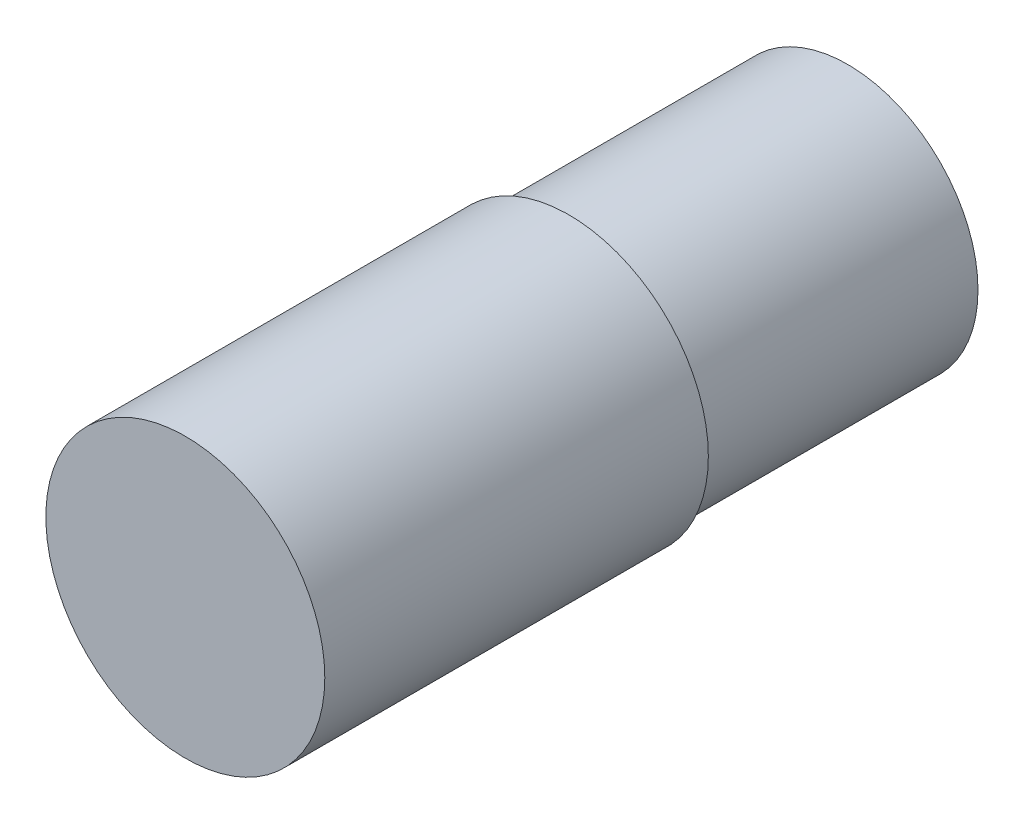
ISO-10303-21;
HEADER;
FILE_DESCRIPTION(('STEP AP214'),'2;1');
FILE_NAME('part.step','',(''),(''),'','','');
FILE_SCHEMA(('AUTOMOTIVE_DESIGN { 1 0 10303 214 1 1 1 1 }'));
ENDSEC;
DATA;
#1=APPLICATION_CONTEXT('core data for automotive mechanical design processes');
#2=APPLICATION_PROTOCOL_DEFINITION('international standard','automotive_design',2000,#1);
#3=PRODUCT_CONTEXT('',#1,'mechanical');
#4=PRODUCT('Part','Part','',(#3));
#5=PRODUCT_RELATED_PRODUCT_CATEGORY('part','',(#4));
#6=PRODUCT_DEFINITION_FORMATION('','',#4);
#7=PRODUCT_DEFINITION_CONTEXT('part definition',#1,'design');
#8=PRODUCT_DEFINITION('design','',#6,#7);
#9=PRODUCT_DEFINITION_SHAPE('','',#8);
#10=(LENGTH_UNIT() NAMED_UNIT(*) SI_UNIT(.MILLI.,.METRE.));
#11=(NAMED_UNIT(*) PLANE_ANGLE_UNIT() SI_UNIT($,.RADIAN.));
#12=(NAMED_UNIT(*) SI_UNIT($,.STERADIAN.) SOLID_ANGLE_UNIT());
#13=UNCERTAINTY_MEASURE_WITH_UNIT(LENGTH_MEASURE(1.E-05),#10,'distance_accuracy_value','');
#14=(GEOMETRIC_REPRESENTATION_CONTEXT(3) GLOBAL_UNCERTAINTY_ASSIGNED_CONTEXT((#13)) GLOBAL_UNIT_ASSIGNED_CONTEXT((#10,
#11,#12)) REPRESENTATION_CONTEXT('',''));
#15=CARTESIAN_POINT('',(0.,0.,0.));
#16=DIRECTION('',(0.,0.,1.));
#17=DIRECTION('',(1.,0.,0.));
#18=AXIS2_PLACEMENT_3D('',#15,#16,#17);
#19=CARTESIAN_POINT('',(0.,0.,60.));
#20=DIRECTION('',(0.,0.,-1.));
#21=DIRECTION('',(-1.,0.,0.));
#22=AXIS2_PLACEMENT_3D('',#19,#20,#21);
#23=CYLINDRICAL_SURFACE('',#22,28.);
#24=CARTESIAN_POINT('',(0.,0.,60.));
#25=DIRECTION('',(0.,0.,1.));
#26=DIRECTION('',(1.,0.,0.));
#27=AXIS2_PLACEMENT_3D('',#24,#25,#26);
#28=CIRCLE('',#27,28.);
#29=CARTESIAN_POINT('',(28.,0.,60.));
#30=VERTEX_POINT('',#29);
#31=EDGE_CURVE('E10',#30,#30,#28,.T.);
#32=ORIENTED_EDGE('',*,*,#31,.F.);
#33=EDGE_LOOP('',(#32));
#34=FACE_BOUND('',#33,.T.);
#35=CARTESIAN_POINT('',(0.,0.,0.));
#36=DIRECTION('',(0.,0.,1.));
#37=DIRECTION('',(1.,0.,0.));
#38=AXIS2_PLACEMENT_3D('',#35,#36,#37);
#39=CIRCLE('',#38,28.);
#40=CARTESIAN_POINT('',(28.,0.,0.));
#41=VERTEX_POINT('',#40);
#42=EDGE_CURVE('E37',#41,#41,#39,.T.);
#43=ORIENTED_EDGE('',*,*,#42,.T.);
#44=EDGE_LOOP('',(#43));
#45=FACE_BOUND('',#44,.T.);
#46=ADVANCED_FACE('F31',(#34,#45),#23,.T.);
#47=CARTESIAN_POINT('',(0.,0.,0.));
#48=DIRECTION('',(0.,0.,1.));
#49=DIRECTION('',(1.,0.,0.));
#50=AXIS2_PLACEMENT_3D('',#47,#48,#49);
#51=PLANE('',#50);
#52=ORIENTED_EDGE('',*,*,#42,.F.);
#53=EDGE_LOOP('',(#52));
#54=FACE_BOUND('',#53,.T.);
#55=ADVANCED_FACE('F55',(#54),#51,.F.);
#56=CARTESIAN_POINT('',(0.,0.,60.));
#57=DIRECTION('',(0.,0.,1.));
#58=DIRECTION('',(1.,0.,0.));
#59=AXIS2_PLACEMENT_3D('',#56,#57,#58);
#60=PLANE('',#59);
#61=CARTESIAN_POINT('',(0.,0.,60.));
#62=DIRECTION('',(0.,0.,1.));
#63=DIRECTION('',(1.,0.,0.));
#64=AXIS2_PLACEMENT_3D('',#61,#62,#63);
#65=CIRCLE('',#64,30.);
#66=CARTESIAN_POINT('',(30.,0.,60.));
#67=VERTEX_POINT('',#66);
#68=EDGE_CURVE('E45',#67,#67,#65,.T.);
#69=ORIENTED_EDGE('',*,*,#68,.F.);
#70=EDGE_LOOP('',(#69));
#71=FACE_BOUND('',#70,.T.);
#72=ORIENTED_EDGE('',*,*,#31,.T.);
#73=EDGE_LOOP('',(#72));
#74=FACE_BOUND('',#73,.T.);
#75=ADVANCED_FACE('F53',(#71,#74),#60,.F.);
#76=CARTESIAN_POINT('',(0.,0.,142.5));
#77=DIRECTION('',(0.,0.,-1.));
#78=DIRECTION('',(-1.,0.,0.));
#79=AXIS2_PLACEMENT_3D('',#76,#77,#78);
#80=CYLINDRICAL_SURFACE('',#79,30.);
#81=CARTESIAN_POINT('',(0.,0.,142.5));
#82=DIRECTION('',(0.,0.,1.));
#83=DIRECTION('',(1.,0.,0.));
#84=AXIS2_PLACEMENT_3D('',#81,#82,#83);
#85=CIRCLE('',#84,30.);
#86=CARTESIAN_POINT('',(30.,0.,142.5));
#87=VERTEX_POINT('',#86);
#88=EDGE_CURVE('E41',#87,#87,#85,.T.);
#89=ORIENTED_EDGE('',*,*,#88,.F.);
#90=EDGE_LOOP('',(#89));
#91=FACE_BOUND('',#90,.T.);
#92=ORIENTED_EDGE('',*,*,#68,.T.);
#93=EDGE_LOOP('',(#92));
#94=FACE_BOUND('',#93,.T.);
#95=ADVANCED_FACE('F51',(#91,#94),#80,.T.);
#96=CARTESIAN_POINT('',(0.,0.,142.5));
#97=DIRECTION('',(0.,0.,1.));
#98=DIRECTION('',(1.,0.,0.));
#99=AXIS2_PLACEMENT_3D('',#96,#97,#98);
#100=PLANE('',#99);
#101=ORIENTED_EDGE('',*,*,#88,.T.);
#102=EDGE_LOOP('',(#101));
#103=FACE_BOUND('',#102,.T.);
#104=ADVANCED_FACE('F61',(#103),#100,.T.);
#105=CLOSED_SHELL('',(#46,#55,#75,#95,#104));
#106=MANIFOLD_SOLID_BREP('B2',#105);
#107=ADVANCED_BREP_SHAPE_REPRESENTATION('',(#18,#106),#14);
#108=SHAPE_DEFINITION_REPRESENTATION(#9,#107);
ENDSEC;
END-ISO-10303-21;
